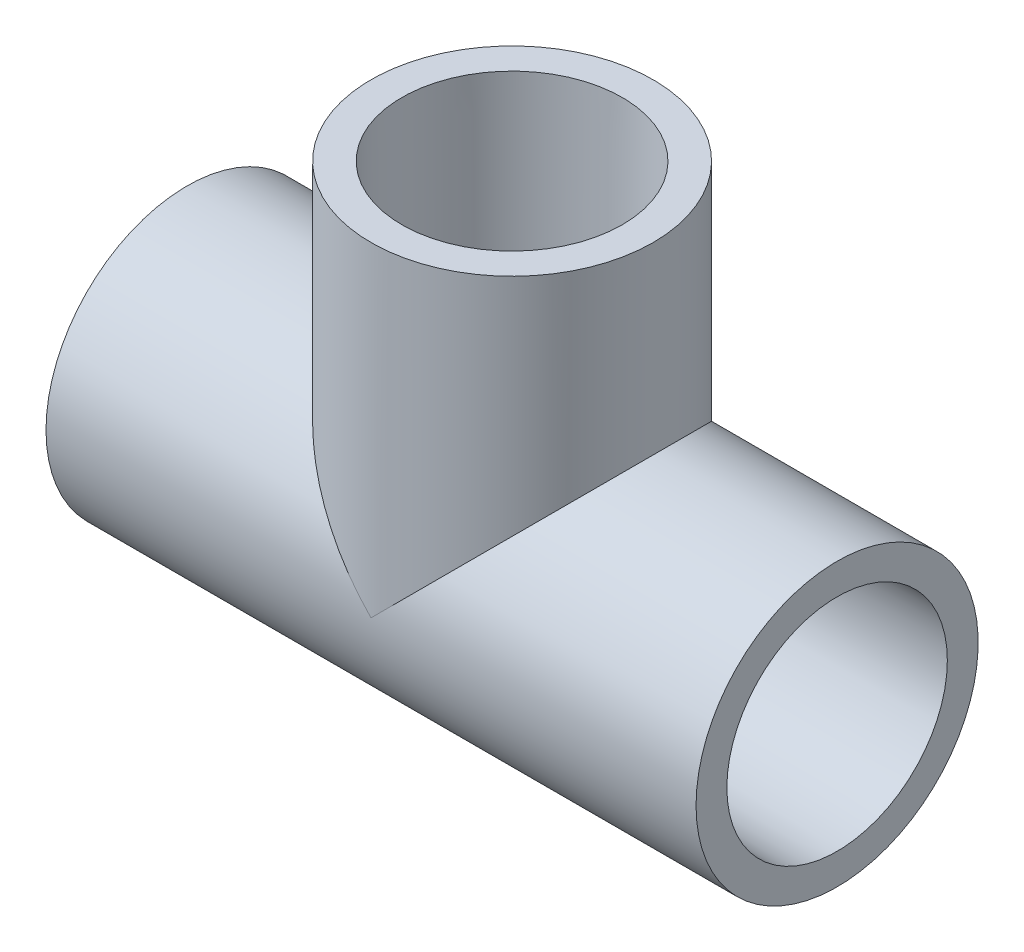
from build123d import *

# Parameters (mm, degrees)
BOSS_EXTRUDE1_START = 25.4
SKETCH4_R           = 13.7795
BOSS_EXTRUDE1_DEPTH = 25.4
SKETCH5_R           = 13.7795
BOSS_EXTRUDE2_DEPTH = 12.7


with BuildPart() as part:
    # Sketch1 → Revolve1 (revolve)
    with BuildSketch(Plane.XY, mode=Mode.PRIVATE) as revolve1_sk:
        Polygon((-31.75, -13.7795), (-12.7, -13.7795), (-12.7, -10.6172), (-31.75, -10.7696), align=None)
        Polygon((31.75, -10.7696), (12.7, -10.6172), (12.7, -13.7795), (31.75, -13.7795), align=None)
    revolve(revolve1_sk.sketch.rotate(Axis((-31.75, 0, 0), (1, 0, 0)), 270), axis=Axis((-31.75, 0, 0), (1, 0, 0)))



with BuildPart() as body_2:
    # Sketch2 → Revolve2 (revolve)
    with BuildSketch(Plane.XY):
        Polygon((10.7696, 31.75), (10.6172, 12.7), (13.7795, 12.7), (13.7795, 31.75), align=None)
    revolve(axis=Axis((0, 0, 0), (0, 1, 0)))


with BuildPart() as part_1:
    add(part.part)

    add(body_2.part)  # Boss-Extrude1 merges body 2
    # Sketch4 → Boss-Extrude1 (add)
    with BuildSketch(Plane(origin=(-12.7, 0, 0), x_dir=(0, 0, -1), z_dir=(1, 0, 0)).offset(BOSS_EXTRUDE1_START)):
        with Locations(Location((0, 0, 0), (0, 0, 180))):
            Circle(SKETCH4_R)
    extrude(amount=-BOSS_EXTRUDE1_DEPTH)

    # Sketch5 → Boss-Extrude2 (add)
    with BuildSketch(Plane.XZ.offset(-12.7)):
        Circle(SKETCH5_R)
    extrude(amount=BOSS_EXTRUDE2_DEPTH)

    # Sketch6 → Cut-Revolve1 (revolve, cut)
    with BuildSketch(Plane.XY, mode=Mode.PRIVATE) as cut_revolve1_sk:
        Polygon((-31.75, -10.7696), (-12.7, -10.6172), (-12.7, -7.8994), (12.7, -7.8994), (12.7, -10.6172), (31.75, -10.7696), (31.75, 0), (-31.75, 0), align=None)
    revolve(cut_revolve1_sk.sketch.rotate(Axis((31.75, 0, 0), (-1, 0, 0)), 270), axis=Axis((31.75, 0, 0), (-1, 0, 0)), mode=Mode.SUBTRACT)

    # Sketch7 → Cut-Revolve2 (revolve, cut)
    with BuildSketch(Plane.XY):
        Polygon((10.7696, 31.75), (10.6172, 12.7), (7.8994, 12.7), (7.8994, 0), (0, 0), (0, 31.75), align=None)
    revolve(axis=Axis((0, 0, 0), (0, 1, 0)), mode=Mode.SUBTRACT)


solid = part_1.part
